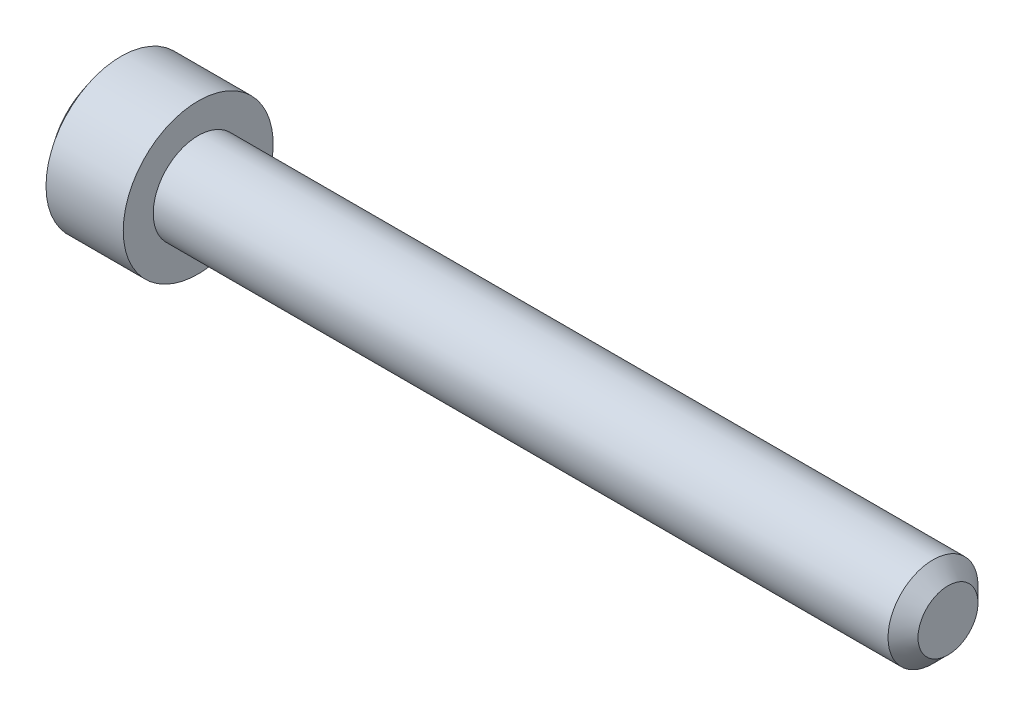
from build123d import *

# Parameters (mm, degrees)
ENL_V_MAT_EXTRU_1_DEPTH = 3


with BuildPart() as part:
    # Esquisse1 → Base-R_volution (revolve)
    with BuildSketch(Plane.XY, mode=Mode.PRIVATE) as base_r_volution_sk:
        Polygon((0, 0), (0, 3.86862915), (0.848528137, 5), (6, 5), (6, 3), (55, 3), (56, 2), (56, 0), align=None)
    revolve(base_r_volution_sk.sketch.rotate(Axis((-28.576196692, 0, 0), (1, 0, 0)), 90), axis=Axis((-28.576196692, 0, 0), (1, 0, 0)))

    # Esquisse2 → Enl_v. mat.-Extru.1 (cut)
    with BuildSketch(Plane(origin=(0, 5.465458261, -1.391437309), x_dir=(0, 0, 1), z_dir=(-1, 0, 0))):
        Polygon((-0.504565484, -7.659075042), (-1.508007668, -5.465458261), (-0.020287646, -2.932907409), (3.287440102, -3.271841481), (4.290882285, -5.465458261), (2.803162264, -7.998009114), align=None)
    extrude(amount=-ENL_V_MAT_EXTRU_1_DEPTH, mode=Mode.SUBTRACT)


solid = part.part
